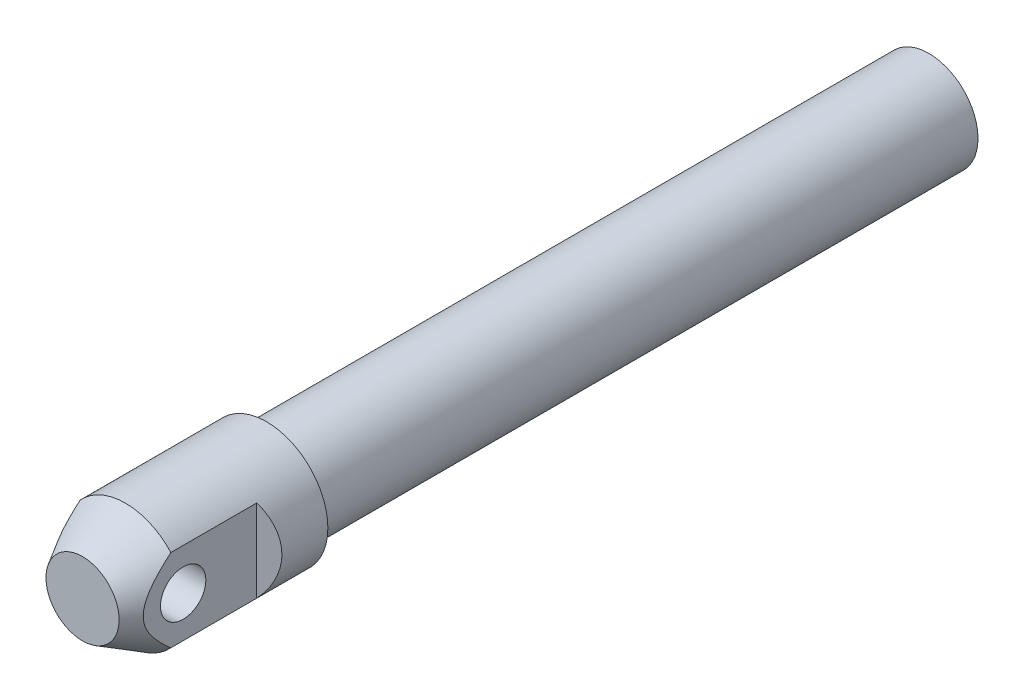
ISO-10303-21;
HEADER;
FILE_DESCRIPTION(('STEP AP214'),'2;1');
FILE_NAME('part.step','',(''),(''),'','','');
FILE_SCHEMA(('AUTOMOTIVE_DESIGN { 1 0 10303 214 1 1 1 1 }'));
ENDSEC;
DATA;
#1=APPLICATION_CONTEXT('core data for automotive mechanical design processes');
#2=APPLICATION_PROTOCOL_DEFINITION('international standard','automotive_design',2000,#1);
#3=PRODUCT_CONTEXT('',#1,'mechanical');
#4=PRODUCT('Part','Part','',(#3));
#5=PRODUCT_RELATED_PRODUCT_CATEGORY('part','',(#4));
#6=PRODUCT_DEFINITION_FORMATION('','',#4);
#7=PRODUCT_DEFINITION_CONTEXT('part definition',#1,'design');
#8=PRODUCT_DEFINITION('design','',#6,#7);
#9=PRODUCT_DEFINITION_SHAPE('','',#8);
#10=(LENGTH_UNIT() NAMED_UNIT(*) SI_UNIT(.MILLI.,.METRE.));
#11=(NAMED_UNIT(*) PLANE_ANGLE_UNIT() SI_UNIT($,.RADIAN.));
#12=(NAMED_UNIT(*) SI_UNIT($,.STERADIAN.) SOLID_ANGLE_UNIT());
#13=UNCERTAINTY_MEASURE_WITH_UNIT(LENGTH_MEASURE(1.E-05),#10,'distance_accuracy_value','');
#14=(GEOMETRIC_REPRESENTATION_CONTEXT(3) GLOBAL_UNCERTAINTY_ASSIGNED_CONTEXT((#13)) GLOBAL_UNIT_ASSIGNED_CONTEXT((#10,
#11,#12)) REPRESENTATION_CONTEXT('',''));
#15=CARTESIAN_POINT('',(0.,0.,0.));
#16=DIRECTION('',(0.,0.,1.));
#17=DIRECTION('',(1.,0.,0.));
#18=AXIS2_PLACEMENT_3D('',#15,#16,#17);
#19=CARTESIAN_POINT('',(0.,0.,20.));
#20=DIRECTION('',(0.,0.,1.));
#21=DIRECTION('',(1.,0.,0.));
#22=AXIS2_PLACEMENT_3D('',#19,#20,#21);
#23=CYLINDRICAL_SURFACE('',#22,5.);
#24=CARTESIAN_POINT('',(0.,0.,0.));
#25=DIRECTION('',(0.,0.,1.));
#26=DIRECTION('',(1.,0.,0.));
#27=AXIS2_PLACEMENT_3D('',#24,#25,#26);
#28=CIRCLE('',#27,5.);
#29=CARTESIAN_POINT('',(5.,0.,0.));
#30=VERTEX_POINT('',#29);
#31=EDGE_CURVE('E82',#30,#30,#28,.T.);
#32=ORIENTED_EDGE('',*,*,#31,.T.);
#33=EDGE_LOOP('',(#32));
#34=FACE_BOUND('',#33,.T.);
#35=CARTESIAN_POINT('',(0.,0.,11.5));
#36=DIRECTION('',(0.,0.,1.));
#37=DIRECTION('',(1.,0.,0.));
#38=AXIS2_PLACEMENT_3D('',#35,#36,#37);
#39=CIRCLE('',#38,5.);
#40=CARTESIAN_POINT('',(-3.7,-3.36303434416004,11.5));
#41=VERTEX_POINT('',#40);
#42=CARTESIAN_POINT('',(3.7,-3.36303434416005,11.5));
#43=VERTEX_POINT('',#42);
#44=EDGE_CURVE('E67',#41,#43,#39,.T.);
#45=ORIENTED_EDGE('',*,*,#44,.F.);
#46=DIRECTION('',(0.,0.,1.));
#47=VECTOR('',#46,1.);
#48=CARTESIAN_POINT('',(-3.7,-3.36303434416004,20.));
#49=LINE('',#48,#47);
#50=CARTESIAN_POINT('',(-3.7,-3.36303434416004,4.5));
#51=VERTEX_POINT('',#50);
#52=EDGE_CURVE('E30',#41,#51,#49,.F.);
#53=ORIENTED_EDGE('',*,*,#52,.T.);
#54=CARTESIAN_POINT('',(0.,0.,6.63619599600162));
#55=DIRECTION('',(0.5,0.,-0.866025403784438));
#56=DIRECTION('',(0.866025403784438,0.,0.5));
#57=AXIS2_PLACEMENT_3D('',#54,#55,#56);
#58=ELLIPSE('',#57,5.77350269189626,5.);
#59=CARTESIAN_POINT('',(-3.7,3.36303434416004,4.5));
#60=VERTEX_POINT('',#59);
#61=EDGE_CURVE('E9',#60,#51,#58,.F.);
#62=ORIENTED_EDGE('',*,*,#61,.F.);
#63=DIRECTION('',(0.,0.,1.));
#64=VECTOR('',#63,1.);
#65=CARTESIAN_POINT('',(-3.7,3.36303434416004,20.));
#66=LINE('',#65,#64);
#67=CARTESIAN_POINT('',(-3.7,3.36303434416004,11.5));
#68=VERTEX_POINT('',#67);
#69=EDGE_CURVE('E63',#60,#68,#66,.T.);
#70=ORIENTED_EDGE('',*,*,#69,.T.);
#71=CARTESIAN_POINT('',(3.7,3.36303434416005,11.5));
#72=VERTEX_POINT('',#71);
#73=EDGE_CURVE('E79',#72,#68,#39,.T.);
#74=ORIENTED_EDGE('',*,*,#73,.F.);
#75=DIRECTION('',(0.,0.,1.));
#76=VECTOR('',#75,1.);
#77=CARTESIAN_POINT('',(3.7,3.36303434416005,20.));
#78=LINE('',#77,#76);
#79=CARTESIAN_POINT('',(3.7,3.36303434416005,4.5));
#80=VERTEX_POINT('',#79);
#81=EDGE_CURVE('E38',#80,#72,#78,.T.);
#82=ORIENTED_EDGE('',*,*,#81,.F.);
#83=CARTESIAN_POINT('',(0.,0.,6.63619599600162));
#84=DIRECTION('',(0.5,0.,0.866025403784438));
#85=DIRECTION('',(-0.866025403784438,0.,0.5));
#86=AXIS2_PLACEMENT_3D('',#83,#84,#85);
#87=ELLIPSE('',#86,5.77350269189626,5.);
#88=CARTESIAN_POINT('',(3.7,-3.36303434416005,4.5));
#89=VERTEX_POINT('',#88);
#90=EDGE_CURVE('E99',#80,#89,#87,.F.);
#91=ORIENTED_EDGE('',*,*,#90,.T.);
#92=DIRECTION('',(0.,0.,1.));
#93=VECTOR('',#92,1.);
#94=CARTESIAN_POINT('',(3.7,-3.36303434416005,20.));
#95=LINE('',#94,#93);
#96=EDGE_CURVE('E74',#43,#89,#95,.F.);
#97=ORIENTED_EDGE('',*,*,#96,.F.);
#98=EDGE_LOOP('',(#45,#53,#62,#70,#74,#82,#91,#97));
#99=FACE_BOUND('',#98,.T.);
#100=ADVANCED_FACE('F14',(#34,#99),#23,.T.);
#101=CARTESIAN_POINT('',(0.,0.,15.));
#102=DIRECTION('',(0.,0.,-1.));
#103=DIRECTION('',(-1.,0.,0.));
#104=AXIS2_PLACEMENT_3D('',#101,#102,#103);
#105=CONICAL_SURFACE('',#104,2.9792740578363,0.523598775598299);
#106=CARTESIAN_POINT('',(0.,0.,15.));
#107=DIRECTION('',(0.,0.,1.));
#108=DIRECTION('',(1.,0.,0.));
#109=AXIS2_PLACEMENT_3D('',#106,#107,#108);
#110=CIRCLE('',#109,2.9792740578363);
#111=CARTESIAN_POINT('',(2.9792740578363,0.,15.));
#112=VERTEX_POINT('',#111);
#113=EDGE_CURVE('E76',#112,#112,#110,.T.);
#114=ORIENTED_EDGE('',*,*,#113,.F.);
#115=EDGE_LOOP('',(#114));
#116=FACE_BOUND('',#115,.T.);
#117=ORIENTED_EDGE('',*,*,#73,.T.);
#118=CARTESIAN_POINT('',(-3.7,-6.88307017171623,6.62511587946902));
#119=CARTESIAN_POINT('',(-3.7,-6.73833515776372,6.84589126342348));
#120=CARTESIAN_POINT('',(-3.7,-6.59291105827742,7.0662188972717));
#121=CARTESIAN_POINT('',(-3.7,-6.30033326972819,7.50575042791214));
#122=CARTESIAN_POINT('',(-3.7,-6.15317942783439,7.72495422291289));
#123=CARTESIAN_POINT('',(-3.7,-5.85630301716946,8.16272745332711));
#124=CARTESIAN_POINT('',(-3.7,-5.70657331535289,8.38129206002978));
#125=CARTESIAN_POINT('',(-3.7,-5.4045777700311,8.81665051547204));
#126=CARTESIAN_POINT('',(-3.7,-5.25231203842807,9.033444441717));
#127=CARTESIAN_POINT('',(-3.7,-4.93959274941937,9.47182261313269));
#128=CARTESIAN_POINT('',(-3.7,-4.7790341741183,9.69333217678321));
#129=CARTESIAN_POINT('',(-3.7,-4.45360648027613,10.1331533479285));
#130=CARTESIAN_POINT('',(-3.7,-4.28873757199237,10.3514651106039));
#131=CARTESIAN_POINT('',(-3.7,-3.95358291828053,10.7834352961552));
#132=CARTESIAN_POINT('',(-3.7,-3.78330512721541,10.9970998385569));
#133=CARTESIAN_POINT('',(-3.7,-3.52220916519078,11.3128625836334));
#134=CARTESIAN_POINT('',(-3.7,-3.43424061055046,11.4173166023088));
#135=CARTESIAN_POINT('',(-3.7,-3.25606095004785,11.6242909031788));
#136=CARTESIAN_POINT('',(-3.7,-3.16584995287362,11.7268112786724));
#137=CARTESIAN_POINT('',(-3.7,-2.9770828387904,11.9357614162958));
#138=CARTESIAN_POINT('',(-3.7,-2.8783565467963,12.0420380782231));
#139=CARTESIAN_POINT('',(-3.7,-2.67726468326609,12.2511563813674));
#140=CARTESIAN_POINT('',(-3.7,-2.57489824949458,12.3539971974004));
#141=CARTESIAN_POINT('',(-3.7,-2.36601212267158,12.5548988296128));
#142=CARTESIAN_POINT('',(-3.7,-2.25950289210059,12.6529704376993));
#143=CARTESIAN_POINT('',(-3.7,-2.04117968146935,12.8429765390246));
#144=CARTESIAN_POINT('',(-3.7,-1.92936775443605,12.9349133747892));
#145=CARTESIAN_POINT('',(-3.7,-1.67081054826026,13.1321107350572));
#146=CARTESIAN_POINT('',(-3.7,-1.52225833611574,13.2350531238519));
#147=CARTESIAN_POINT('',(-3.7,-1.21293438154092,13.4207618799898));
#148=CARTESIAN_POINT('',(-3.7,-1.05218706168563,13.5035672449));
#149=CARTESIAN_POINT('',(-3.7,-0.763418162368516,13.6198541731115));
#150=CARTESIAN_POINT('',(-3.7,-0.638434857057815,13.6606291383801));
#151=CARTESIAN_POINT('',(-3.7,-0.447314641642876,13.7059326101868));
#152=CARTESIAN_POINT('',(-3.7,-0.383025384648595,13.7183888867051));
#153=CARTESIAN_POINT('',(-3.7,-0.253611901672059,13.7375973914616));
#154=CARTESIAN_POINT('',(-3.7,-0.188488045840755,13.744352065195));
#155=CARTESIAN_POINT('',(-3.7,-0.0574941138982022,13.7519008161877));
#156=CARTESIAN_POINT('',(-3.7,0.00837809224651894,13.7526584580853));
#157=CARTESIAN_POINT('',(-3.7,0.139898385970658,13.7481008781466));
#158=CARTESIAN_POINT('',(-3.7,0.205546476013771,13.7427857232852));
#159=CARTESIAN_POINT('',(-3.7,0.401356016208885,13.717996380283));
#160=CARTESIAN_POINT('',(-3.7,0.530452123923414,13.6896819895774));
#161=CARTESIAN_POINT('',(-3.7,0.824518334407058,13.6007661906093));
#162=CARTESIAN_POINT('',(-3.7,0.98711272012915,13.5325512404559));
#163=CARTESIAN_POINT('',(-3.7,1.22231030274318,13.4122918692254));
#164=CARTESIAN_POINT('',(-3.7,1.29967191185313,13.3689194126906));
#165=CARTESIAN_POINT('',(-3.7,1.45144802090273,13.2773068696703));
#166=CARTESIAN_POINT('',(-3.7,1.52586344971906,13.2290683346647));
#167=CARTESIAN_POINT('',(-3.7,1.70779437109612,13.1040762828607));
#168=CARTESIAN_POINT('',(-3.7,1.81365739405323,13.0249345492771));
#169=CARTESIAN_POINT('',(-3.7,2.02032688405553,12.8602589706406));
#170=CARTESIAN_POINT('',(-3.7,2.12113020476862,12.7747212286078));
#171=CARTESIAN_POINT('',(-3.7,2.31881213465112,12.5985709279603));
#172=CARTESIAN_POINT('',(-3.7,2.41567560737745,12.5079414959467));
#173=CARTESIAN_POINT('',(-3.7,2.60582960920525,12.3230041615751));
#174=CARTESIAN_POINT('',(-3.7,2.6991196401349,12.2286957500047));
#175=CARTESIAN_POINT('',(-3.7,2.87693541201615,12.0432265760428));
#176=CARTESIAN_POINT('',(-3.7,2.96164365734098,11.9522399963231));
#177=CARTESIAN_POINT('',(-3.7,3.12882416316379,11.7682260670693));
#178=CARTESIAN_POINT('',(-3.7,3.21129622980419,11.6751985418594));
#179=CARTESIAN_POINT('',(-3.7,3.3736032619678,11.4883079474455));
#180=CARTESIAN_POINT('',(-3.7,3.45345505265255,11.3944594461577));
#181=CARTESIAN_POINT('',(-3.7,3.61150133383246,11.2054158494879));
#182=CARTESIAN_POINT('',(-3.7,3.68969623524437,11.1102210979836));
#183=CARTESIAN_POINT('',(-3.7,3.76719687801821,11.0144726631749));
#184=B_SPLINE_CURVE_WITH_KNOTS('',3,(#118,#119,#120,#121,#122,#123,#124,#125,#126,#127,#128,
#129,#130,#131,#132,#133,#134,#135,#136,#137,#138,#139,#140,#141,#142,#143,#144,#145,#146,#147,
#148,#149,#150,#151,#152,#153,#154,#155,#156,#157,#158,#159,#160,#161,#162,#163,#164,#165,#166,
#167,#168,#169,#170,#171,#172,#173,#174,#175,#176,#177,#178,#179,#180,#181,#182,#183),
.UNSPECIFIED.,.F.,.F.,(4,2,2,2,2,2,2,2,2,2,2,2,2,2,2,2,2,2,2,2,2,2,2,2,2,2,2,2,2,2,2,2,4),(0.,
0.791969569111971,1.58400964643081,2.37879371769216,3.17354281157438,3.9942386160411,
4.81489446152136,5.63439473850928,6.04405485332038,6.45369515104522,6.88879788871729,
7.32400438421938,7.75817528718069,8.19217944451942,8.7333841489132,9.27353225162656,
9.66629783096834,9.86253211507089,10.058682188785,10.2560230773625,10.4533617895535,
10.8478339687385,11.3737159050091,11.6396756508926,11.9055508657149,12.3017340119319,
12.6981605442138,13.0959886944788,13.493872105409,13.8667722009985,14.2397045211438,
14.6093533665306,14.9789094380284),.UNSPECIFIED.);
#185=EDGE_CURVE('E23',#68,#41,#184,.F.);
#186=ORIENTED_EDGE('',*,*,#185,.T.);
#187=ORIENTED_EDGE('',*,*,#44,.T.);
#188=CARTESIAN_POINT('',(3.7,-6.88307017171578,6.62511587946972));
#189=CARTESIAN_POINT('',(3.7,-6.73833515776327,6.84589126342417));
#190=CARTESIAN_POINT('',(3.7,-6.59291105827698,7.06621889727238));
#191=CARTESIAN_POINT('',(3.7,-6.30033326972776,7.50575042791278));
#192=CARTESIAN_POINT('',(3.7,-6.15317942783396,7.72495422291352));
#193=CARTESIAN_POINT('',(3.7,-5.85630301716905,8.16272745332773));
#194=CARTESIAN_POINT('',(3.7,-5.70657331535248,8.38129206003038));
#195=CARTESIAN_POINT('',(3.7,-5.4045777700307,8.81665051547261));
#196=CARTESIAN_POINT('',(3.7,-5.25231203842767,9.03344444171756));
#197=CARTESIAN_POINT('',(3.7,-4.93959274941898,9.47182261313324));
#198=CARTESIAN_POINT('',(3.7,-4.77903417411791,9.69333217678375));
#199=CARTESIAN_POINT('',(3.7,-4.45360648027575,10.133153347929));
#200=CARTESIAN_POINT('',(3.7,-4.28873757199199,10.3514651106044));
#201=CARTESIAN_POINT('',(3.7,-3.95358291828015,10.7834352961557));
#202=CARTESIAN_POINT('',(3.7,-3.78330512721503,10.9970998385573));
#203=CARTESIAN_POINT('',(3.7,-3.5222091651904,11.3128625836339));
#204=CARTESIAN_POINT('',(3.7,-3.43424061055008,11.4173166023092));
#205=CARTESIAN_POINT('',(3.7,-3.25606095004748,11.6242909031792));
#206=CARTESIAN_POINT('',(3.7,-3.16584995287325,11.7268112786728));
#207=CARTESIAN_POINT('',(3.7,-2.97708283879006,11.9357614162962));
#208=CARTESIAN_POINT('',(3.7,-2.87835654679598,12.0420380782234));
#209=CARTESIAN_POINT('',(3.7,-2.6772646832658,12.2511563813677));
#210=CARTESIAN_POINT('',(3.7,-2.57489824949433,12.3539971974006));
#211=CARTESIAN_POINT('',(3.7,-2.36601212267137,12.554898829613));
#212=CARTESIAN_POINT('',(3.7,-2.2595028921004,12.6529704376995));
#213=CARTESIAN_POINT('',(3.7,-2.04117968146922,12.8429765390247));
#214=CARTESIAN_POINT('',(3.7,-1.92936775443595,12.9349133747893));
#215=CARTESIAN_POINT('',(3.7,-1.67081054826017,13.1321107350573));
#216=CARTESIAN_POINT('',(3.7,-1.52225833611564,13.235053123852));
#217=CARTESIAN_POINT('',(3.7,-1.21293438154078,13.4207618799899));
#218=CARTESIAN_POINT('',(3.7,-1.05218706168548,13.5035672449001));
#219=CARTESIAN_POINT('',(3.7,-0.763418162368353,13.6198541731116));
#220=CARTESIAN_POINT('',(3.7,-0.638434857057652,13.6606291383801));
#221=CARTESIAN_POINT('',(3.7,-0.44731464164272,13.7059326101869));
#222=CARTESIAN_POINT('',(3.7,-0.38302538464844,13.7183888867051));
#223=CARTESIAN_POINT('',(3.7,-0.25361190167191,13.7375973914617));
#224=CARTESIAN_POINT('',(3.7,-0.188488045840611,13.7443520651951));
#225=CARTESIAN_POINT('',(3.7,-0.0574941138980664,13.7519008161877));
#226=CARTESIAN_POINT('',(3.7,0.00837809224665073,13.7526584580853));
#227=CARTESIAN_POINT('',(3.7,0.139898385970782,13.7481008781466));
#228=CARTESIAN_POINT('',(3.7,0.20554647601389,13.7427857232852));
#229=CARTESIAN_POINT('',(3.7,0.401356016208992,13.717996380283));
#230=CARTESIAN_POINT('',(3.7,0.530452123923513,13.6896819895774));
#231=CARTESIAN_POINT('',(3.7,0.824518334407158,13.6007661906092));
#232=CARTESIAN_POINT('',(3.7,0.987112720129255,13.5325512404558));
#233=CARTESIAN_POINT('',(3.7,1.22231030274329,13.4122918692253));
#234=CARTESIAN_POINT('',(3.7,1.29967191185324,13.3689194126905));
#235=CARTESIAN_POINT('',(3.7,1.45144802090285,13.2773068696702));
#236=CARTESIAN_POINT('',(3.7,1.52586344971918,13.2290683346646));
#237=CARTESIAN_POINT('',(3.7,1.70779437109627,13.1040762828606));
#238=CARTESIAN_POINT('',(3.7,1.81365739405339,13.024934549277));
#239=CARTESIAN_POINT('',(3.7,2.0203268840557,12.8602589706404));
#240=CARTESIAN_POINT('',(3.7,2.12113020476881,12.7747212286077));
#241=CARTESIAN_POINT('',(3.7,2.31881213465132,12.5985709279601));
#242=CARTESIAN_POINT('',(3.7,2.41567560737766,12.5079414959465));
#243=CARTESIAN_POINT('',(3.7,2.60582960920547,12.3230041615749));
#244=CARTESIAN_POINT('',(3.7,2.69911964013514,12.2286957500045));
#245=CARTESIAN_POINT('',(3.7,2.8769354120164,12.0432265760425));
#246=CARTESIAN_POINT('',(3.7,2.96164365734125,11.9522399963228));
#247=CARTESIAN_POINT('',(3.7,3.12882416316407,11.768226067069));
#248=CARTESIAN_POINT('',(3.7,3.21129622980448,11.6751985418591));
#249=CARTESIAN_POINT('',(3.7,3.37360326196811,11.4883079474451));
#250=CARTESIAN_POINT('',(3.7,3.45345505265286,11.3944594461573));
#251=CARTESIAN_POINT('',(3.7,3.6115013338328,11.2054158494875));
#252=CARTESIAN_POINT('',(3.7,3.68969623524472,11.1102210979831));
#253=CARTESIAN_POINT('',(3.7,3.76719687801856,11.0144726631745));
#254=B_SPLINE_CURVE_WITH_KNOTS('',3,(#188,#189,#190,#191,#192,#193,#194,#195,#196,#197,#198,
#199,#200,#201,#202,#203,#204,#205,#206,#207,#208,#209,#210,#211,#212,#213,#214,#215,#216,#217,
#218,#219,#220,#221,#222,#223,#224,#225,#226,#227,#228,#229,#230,#231,#232,#233,#234,#235,#236,
#237,#238,#239,#240,#241,#242,#243,#244,#245,#246,#247,#248,#249,#250,#251,#252,#253),
.UNSPECIFIED.,.F.,.F.,(4,2,2,2,2,2,2,2,2,2,2,2,2,2,2,2,2,2,2,2,2,2,2,2,2,2,2,2,2,2,2,2,4),(0.,
0.791969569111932,1.58400964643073,2.37879371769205,3.17354281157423,3.99423861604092,
4.81489446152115,5.63439473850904,6.04405485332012,6.45369515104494,6.8887978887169,
7.32400438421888,7.75817528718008,8.19217944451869,8.73338414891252,9.27353225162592,
9.66629783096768,9.86253211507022,10.0586821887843,10.2560230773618,10.4533617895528,
10.8478339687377,11.3737159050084,11.6396756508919,11.9055508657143,12.3017340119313,
12.6981605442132,13.0959886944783,13.4938721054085,13.8667722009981,14.2397045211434,
14.6093533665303,14.9789094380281),.UNSPECIFIED.);
#255=EDGE_CURVE('E91',#72,#43,#254,.F.);
#256=ORIENTED_EDGE('',*,*,#255,.F.);
#257=EDGE_LOOP('',(#117,#186,#187,#256));
#258=FACE_BOUND('',#257,.T.);
#259=ADVANCED_FACE('F104',(#116,#258),#105,.T.);
#260=CARTESIAN_POINT('',(0.,2.9792740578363,15.));
#261=DIRECTION('',(0.,0.,-1.));
#262=DIRECTION('',(-1.,0.,0.));
#263=AXIS2_PLACEMENT_3D('',#260,#261,#262);
#264=PLANE('',#263);
#265=ORIENTED_EDGE('',*,*,#113,.T.);
#266=EDGE_LOOP('',(#265));
#267=FACE_BOUND('',#266,.T.);
#268=ADVANCED_FACE('F16',(#267),#264,.F.);
#269=CARTESIAN_POINT('',(0.,4.,-54.));
#270=DIRECTION('',(0.,0.,-1.));
#271=DIRECTION('',(-1.,0.,0.));
#272=AXIS2_PLACEMENT_3D('',#269,#270,#271);
#273=PLANE('',#272);
#274=CARTESIAN_POINT('',(0.,0.,-54.));
#275=DIRECTION('',(0.,0.,1.));
#276=DIRECTION('',(1.,0.,0.));
#277=AXIS2_PLACEMENT_3D('',#274,#275,#276);
#278=CIRCLE('',#277,4.);
#279=CARTESIAN_POINT('',(4.,0.,-54.));
#280=VERTEX_POINT('',#279);
#281=EDGE_CURVE('E88',#280,#280,#278,.T.);
#282=ORIENTED_EDGE('',*,*,#281,.F.);
#283=EDGE_LOOP('',(#282));
#284=FACE_BOUND('',#283,.T.);
#285=ADVANCED_FACE('F147',(#284),#273,.T.);
#286=CARTESIAN_POINT('',(0.,0.,20.));
#287=DIRECTION('',(0.,0.,1.));
#288=DIRECTION('',(1.,0.,0.));
#289=AXIS2_PLACEMENT_3D('',#286,#287,#288);
#290=CYLINDRICAL_SURFACE('',#289,4.);
#291=ORIENTED_EDGE('',*,*,#281,.T.);
#292=EDGE_LOOP('',(#291));
#293=FACE_BOUND('',#292,.T.);
#294=CARTESIAN_POINT('',(0.,0.,0.));
#295=DIRECTION('',(0.,0.,1.));
#296=DIRECTION('',(1.,0.,0.));
#297=AXIS2_PLACEMENT_3D('',#294,#295,#296);
#298=CIRCLE('',#297,4.);
#299=CARTESIAN_POINT('',(4.,0.,0.));
#300=VERTEX_POINT('',#299);
#301=EDGE_CURVE('E85',#300,#300,#298,.T.);
#302=ORIENTED_EDGE('',*,*,#301,.F.);
#303=EDGE_LOOP('',(#302));
#304=FACE_BOUND('',#303,.T.);
#305=ADVANCED_FACE('F134',(#293,#304),#290,.T.);
#306=CARTESIAN_POINT('',(0.,4.,0.));
#307=DIRECTION('',(0.,0.,1.));
#308=DIRECTION('',(1.,0.,0.));
#309=AXIS2_PLACEMENT_3D('',#306,#307,#308);
#310=PLANE('',#309);
#311=ORIENTED_EDGE('',*,*,#31,.F.);
#312=EDGE_LOOP('',(#311));
#313=FACE_BOUND('',#312,.T.);
#314=ORIENTED_EDGE('',*,*,#301,.T.);
#315=EDGE_LOOP('',(#314));
#316=FACE_BOUND('',#315,.T.);
#317=ADVANCED_FACE('F125',(#313,#316),#310,.F.);
#318=CARTESIAN_POINT('',(3.7,-15.,4.5));
#319=DIRECTION('',(0.5,0.,0.866025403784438));
#320=DIRECTION('',(0.866025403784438,0.,-0.5));
#321=AXIS2_PLACEMENT_3D('',#318,#319,#320);
#322=PLANE('',#321);
#323=DIRECTION('',(0.,1.,0.));
#324=VECTOR('',#323,1.);
#325=CARTESIAN_POINT('',(3.7,-15.,4.5));
#326=LINE('',#325,#324);
#327=EDGE_CURVE('E68',#89,#80,#326,.T.);
#328=ORIENTED_EDGE('',*,*,#327,.F.);
#329=ORIENTED_EDGE('',*,*,#90,.F.);
#330=EDGE_LOOP('',(#328,#329));
#331=FACE_BOUND('',#330,.T.);
#332=ADVANCED_FACE('F123',(#331),#322,.T.);
#333=CARTESIAN_POINT('',(3.7,-15.,4.5));
#334=DIRECTION('',(-1.,0.,0.));
#335=DIRECTION('',(0.,0.,1.));
#336=AXIS2_PLACEMENT_3D('',#333,#334,#335);
#337=PLANE('',#336);
#338=CARTESIAN_POINT('',(3.7,0.,10.5));
#339=DIRECTION('',(1.,0.,0.));
#340=DIRECTION('',(0.,0.,-1.));
#341=AXIS2_PLACEMENT_3D('',#338,#339,#340);
#342=CIRCLE('',#341,1.85);
#343=CARTESIAN_POINT('',(3.7,0.,8.65));
#344=VERTEX_POINT('',#343);
#345=EDGE_CURVE('E233',#344,#344,#342,.T.);
#346=ORIENTED_EDGE('',*,*,#345,.F.);
#347=EDGE_LOOP('',(#346));
#348=FACE_BOUND('',#347,.T.);
#349=ORIENTED_EDGE('',*,*,#96,.T.);
#350=ORIENTED_EDGE('',*,*,#327,.T.);
#351=ORIENTED_EDGE('',*,*,#81,.T.);
#352=ORIENTED_EDGE('',*,*,#255,.T.);
#353=EDGE_LOOP('',(#349,#350,#351,#352));
#354=FACE_BOUND('',#353,.T.);
#355=ADVANCED_FACE('F101',(#348,#354),#337,.F.);
#356=CARTESIAN_POINT('',(-3.7,-15.,4.5));
#357=DIRECTION('',(-1.,0.,0.));
#358=DIRECTION('',(0.,0.,1.));
#359=AXIS2_PLACEMENT_3D('',#356,#357,#358);
#360=PLANE('',#359);
#361=CARTESIAN_POINT('',(-3.7,0.,10.5));
#362=DIRECTION('',(-1.,0.,0.));
#363=DIRECTION('',(0.,0.,1.));
#364=AXIS2_PLACEMENT_3D('',#361,#362,#363);
#365=CIRCLE('',#364,1.85);
#366=CARTESIAN_POINT('',(-3.7,0.,12.35));
#367=VERTEX_POINT('',#366);
#368=EDGE_CURVE('E18',#367,#367,#365,.T.);
#369=ORIENTED_EDGE('',*,*,#368,.F.);
#370=EDGE_LOOP('',(#369));
#371=FACE_BOUND('',#370,.T.);
#372=ORIENTED_EDGE('',*,*,#185,.F.);
#373=ORIENTED_EDGE('',*,*,#69,.F.);
#374=DIRECTION('',(0.,1.,0.));
#375=VECTOR('',#374,1.);
#376=CARTESIAN_POINT('',(-3.7,-15.,4.5));
#377=LINE('',#376,#375);
#378=EDGE_CURVE('E59',#51,#60,#377,.T.);
#379=ORIENTED_EDGE('',*,*,#378,.F.);
#380=ORIENTED_EDGE('',*,*,#52,.F.);
#381=EDGE_LOOP('',(#372,#373,#379,#380));
#382=FACE_BOUND('',#381,.T.);
#383=ADVANCED_FACE('F62',(#371,#382),#360,.T.);
#384=CARTESIAN_POINT('',(-3.7,-15.,4.5));
#385=DIRECTION('',(0.5,0.,-0.866025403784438));
#386=DIRECTION('',(-0.866025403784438,0.,-0.5));
#387=AXIS2_PLACEMENT_3D('',#384,#385,#386);
#388=PLANE('',#387);
#389=ORIENTED_EDGE('',*,*,#61,.T.);
#390=ORIENTED_EDGE('',*,*,#378,.T.);
#391=EDGE_LOOP('',(#389,#390));
#392=FACE_BOUND('',#391,.T.);
#393=ADVANCED_FACE('F58',(#392),#388,.F.);
#394=CARTESIAN_POINT('',(-5.,0.,10.5));
#395=DIRECTION('',(1.,0.,0.));
#396=DIRECTION('',(0.,0.,-1.));
#397=AXIS2_PLACEMENT_3D('',#394,#395,#396);
#398=CYLINDRICAL_SURFACE('',#397,1.85);
#399=ORIENTED_EDGE('',*,*,#368,.T.);
#400=EDGE_LOOP('',(#399));
#401=FACE_BOUND('',#400,.T.);
#402=ORIENTED_EDGE('',*,*,#345,.T.);
#403=EDGE_LOOP('',(#402));
#404=FACE_BOUND('',#403,.T.);
#405=ADVANCED_FACE('F121',(#401,#404),#398,.F.);
#406=CLOSED_SHELL('',(#100,#259,#268,#285,#305,#317,#332,#355,#383,#393,#405));
#407=MANIFOLD_SOLID_BREP('B1',#406);
#408=ADVANCED_BREP_SHAPE_REPRESENTATION('',(#18,#407),#14);
#409=SHAPE_DEFINITION_REPRESENTATION(#9,#408);
ENDSEC;
END-ISO-10303-21;
